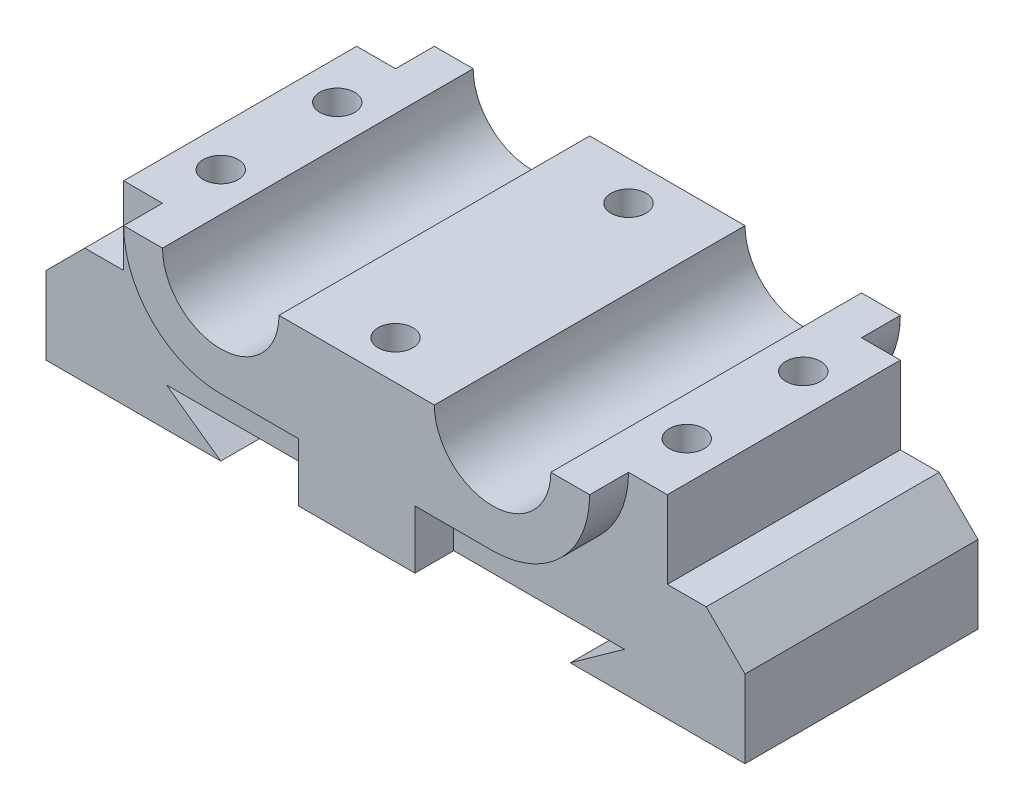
ISO-10303-21;
HEADER;
FILE_DESCRIPTION(('STEP AP214'),'2;1');
FILE_NAME('part.step','',(''),(''),'','','');
FILE_SCHEMA(('AUTOMOTIVE_DESIGN { 1 0 10303 214 1 1 1 1 }'));
ENDSEC;
DATA;
#1=APPLICATION_CONTEXT('core data for automotive mechanical design processes');
#2=APPLICATION_PROTOCOL_DEFINITION('international standard','automotive_design',2000,#1);
#3=PRODUCT_CONTEXT('',#1,'mechanical');
#4=PRODUCT('Part','Part','',(#3));
#5=PRODUCT_RELATED_PRODUCT_CATEGORY('part','',(#4));
#6=PRODUCT_DEFINITION_FORMATION('','',#4);
#7=PRODUCT_DEFINITION_CONTEXT('part definition',#1,'design');
#8=PRODUCT_DEFINITION('design','',#6,#7);
#9=PRODUCT_DEFINITION_SHAPE('','',#8);
#10=(LENGTH_UNIT() NAMED_UNIT(*) SI_UNIT(.MILLI.,.METRE.));
#11=(NAMED_UNIT(*) PLANE_ANGLE_UNIT() SI_UNIT($,.RADIAN.));
#12=(NAMED_UNIT(*) SI_UNIT($,.STERADIAN.) SOLID_ANGLE_UNIT());
#13=UNCERTAINTY_MEASURE_WITH_UNIT(LENGTH_MEASURE(1.E-05),#10,'distance_accuracy_value','');
#14=(GEOMETRIC_REPRESENTATION_CONTEXT(3) GLOBAL_UNCERTAINTY_ASSIGNED_CONTEXT((#13)) GLOBAL_UNIT_ASSIGNED_CONTEXT((#10,
#11,#12)) REPRESENTATION_CONTEXT('',''));
#15=CARTESIAN_POINT('',(0.,0.,0.));
#16=DIRECTION('',(0.,0.,1.));
#17=DIRECTION('',(1.,0.,0.));
#18=AXIS2_PLACEMENT_3D('',#15,#16,#17);
#19=CARTESIAN_POINT('',(17.5,25.,15.));
#20=DIRECTION('',(0.,0.,-1.));
#21=DIRECTION('',(-1.,0.,0.));
#22=AXIS2_PLACEMENT_3D('',#19,#20,#21);
#23=PLANE('',#22);
#24=DIRECTION('',(1.,0.,0.));
#25=VECTOR('',#24,1.);
#26=CARTESIAN_POINT('',(-45.,15.,15.));
#27=LINE('',#26,#25);
#28=CARTESIAN_POINT('',(-40.,15.,15.));
#29=VERTEX_POINT('',#28);
#30=CARTESIAN_POINT('',(-35.,15.,15.));
#31=VERTEX_POINT('',#30);
#32=EDGE_CURVE('E477',#29,#31,#27,.T.);
#33=ORIENTED_EDGE('',*,*,#32,.F.);
#34=DIRECTION('',(0.707106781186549,0.707106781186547,0.));
#35=VECTOR('',#34,1.);
#36=CARTESIAN_POINT('',(-45.,10.,15.));
#37=LINE('',#36,#35);
#38=CARTESIAN_POINT('',(-45.,10.,15.));
#39=VERTEX_POINT('',#38);
#40=EDGE_CURVE('E593',#29,#39,#37,.F.);
#41=ORIENTED_EDGE('',*,*,#40,.T.);
#42=DIRECTION('',(0.,1.,0.));
#43=VECTOR('',#42,1.);
#44=CARTESIAN_POINT('',(-45.,0.,15.));
#45=LINE('',#44,#43);
#46=CARTESIAN_POINT('',(-45.,0.,15.));
#47=VERTEX_POINT('',#46);
#48=EDGE_CURVE('E480',#47,#39,#45,.T.);
#49=ORIENTED_EDGE('',*,*,#48,.F.);
#50=DIRECTION('',(1.,0.,0.));
#51=VECTOR('',#50,1.);
#52=CARTESIAN_POINT('',(-45.,0.,15.));
#53=LINE('',#52,#51);
#54=CARTESIAN_POINT('',(-22.5,0.,15.));
#55=VERTEX_POINT('',#54);
#56=EDGE_CURVE('E484',#47,#55,#53,.T.);
#57=ORIENTED_EDGE('',*,*,#56,.T.);
#58=DIRECTION('',(-0.81262275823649,0.582790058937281,0.));
#59=VECTOR('',#58,1.);
#60=CARTESIAN_POINT('',(-22.5,0.,15.));
#61=LINE('',#60,#59);
#62=CARTESIAN_POINT('',(-29.4718309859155,5.,15.));
#63=VERTEX_POINT('',#62);
#64=EDGE_CURVE('E430',#55,#63,#61,.T.);
#65=ORIENTED_EDGE('',*,*,#64,.T.);
#66=DIRECTION('',(1.,0.,0.));
#67=VECTOR('',#66,1.);
#68=CARTESIAN_POINT('',(-29.4718309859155,5.,15.));
#69=LINE('',#68,#67);
#70=CARTESIAN_POINT('',(-7.5,5.,15.));
#71=VERTEX_POINT('',#70);
#72=EDGE_CURVE('E436',#63,#71,#69,.T.);
#73=ORIENTED_EDGE('',*,*,#72,.T.);
#74=DIRECTION('',(0.,-1.,0.));
#75=VECTOR('',#74,1.);
#76=CARTESIAN_POINT('',(-7.50000000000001,25.,15.));
#77=LINE('',#76,#75);
#78=CARTESIAN_POINT('',(-7.5,12.5,15.));
#79=VERTEX_POINT('',#78);
#80=EDGE_CURVE('E422',#79,#71,#77,.T.);
#81=ORIENTED_EDGE('',*,*,#80,.F.);
#82=DIRECTION('',(-1.,0.,0.));
#83=VECTOR('',#82,1.);
#84=CARTESIAN_POINT('',(17.5,12.5,15.));
#85=LINE('',#84,#83);
#86=CARTESIAN_POINT('',(-17.5,12.5,15.));
#87=VERTEX_POINT('',#86);
#88=EDGE_CURVE('E426',#79,#87,#85,.T.);
#89=ORIENTED_EDGE('',*,*,#88,.T.);
#90=CARTESIAN_POINT('',(-17.5,25.,15.));
#91=DIRECTION('',(0.,0.,1.));
#92=DIRECTION('',(1.,0.,0.));
#93=AXIS2_PLACEMENT_3D('',#90,#91,#92);
#94=CIRCLE('',#93,12.5);
#95=CARTESIAN_POINT('',(-30.,25.,15.));
#96=VERTEX_POINT('',#95);
#97=EDGE_CURVE('E465',#96,#87,#94,.T.);
#98=ORIENTED_EDGE('',*,*,#97,.F.);
#99=DIRECTION('',(1.,0.,0.));
#100=VECTOR('',#99,1.);
#101=CARTESIAN_POINT('',(-35.,25.,15.));
#102=LINE('',#101,#100);
#103=CARTESIAN_POINT('',(-35.,25.,15.));
#104=VERTEX_POINT('',#103);
#105=EDGE_CURVE('E469',#104,#96,#102,.T.);
#106=ORIENTED_EDGE('',*,*,#105,.F.);
#107=DIRECTION('',(0.,1.,0.));
#108=VECTOR('',#107,1.);
#109=CARTESIAN_POINT('',(-35.,15.,15.));
#110=LINE('',#109,#108);
#111=EDGE_CURVE('E473',#31,#104,#110,.T.);
#112=ORIENTED_EDGE('',*,*,#111,.F.);
#113=EDGE_LOOP('',(#33,#41,#49,#57,#65,#73,#81,#89,#98,#106,#112));
#114=FACE_BOUND('',#113,.T.);
#115=ADVANCED_FACE('F41',(#114),#23,.F.);
#116=CARTESIAN_POINT('',(17.5,25.,-15.));
#117=DIRECTION('',(0.,0.,-1.));
#118=DIRECTION('',(-1.,0.,0.));
#119=AXIS2_PLACEMENT_3D('',#116,#117,#118);
#120=PLANE('',#119);
#121=DIRECTION('',(0.,1.,0.));
#122=VECTOR('',#121,1.);
#123=CARTESIAN_POINT('',(-45.,0.,-15.));
#124=LINE('',#123,#122);
#125=CARTESIAN_POINT('',(-45.,0.,-15.));
#126=VERTEX_POINT('',#125);
#127=CARTESIAN_POINT('',(-45.,10.,-15.));
#128=VERTEX_POINT('',#127);
#129=EDGE_CURVE('E536',#126,#128,#124,.T.);
#130=ORIENTED_EDGE('',*,*,#129,.T.);
#131=DIRECTION('',(-0.707106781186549,-0.707106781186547,0.));
#132=VECTOR('',#131,1.);
#133=CARTESIAN_POINT('',(-6.24999999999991,48.75,-15.));
#134=LINE('',#133,#132);
#135=CARTESIAN_POINT('',(-40.,15.,-15.));
#136=VERTEX_POINT('',#135);
#137=EDGE_CURVE('E587',#128,#136,#134,.F.);
#138=ORIENTED_EDGE('',*,*,#137,.T.);
#139=DIRECTION('',(1.,0.,0.));
#140=VECTOR('',#139,1.);
#141=CARTESIAN_POINT('',(-45.,15.,-15.));
#142=LINE('',#141,#140);
#143=CARTESIAN_POINT('',(-35.,15.,-15.));
#144=VERTEX_POINT('',#143);
#145=EDGE_CURVE('E533',#136,#144,#142,.T.);
#146=ORIENTED_EDGE('',*,*,#145,.T.);
#147=DIRECTION('',(0.,1.,0.));
#148=VECTOR('',#147,1.);
#149=CARTESIAN_POINT('',(-35.,15.,-15.));
#150=LINE('',#149,#148);
#151=CARTESIAN_POINT('',(-35.,25.,-15.));
#152=VERTEX_POINT('',#151);
#153=EDGE_CURVE('E529',#144,#152,#150,.T.);
#154=ORIENTED_EDGE('',*,*,#153,.T.);
#155=DIRECTION('',(1.,0.,0.));
#156=VECTOR('',#155,1.);
#157=CARTESIAN_POINT('',(-35.,25.,-15.));
#158=LINE('',#157,#156);
#159=CARTESIAN_POINT('',(-30.,25.,-15.));
#160=VERTEX_POINT('',#159);
#161=EDGE_CURVE('E526',#152,#160,#158,.T.);
#162=ORIENTED_EDGE('',*,*,#161,.T.);
#163=CARTESIAN_POINT('',(-17.5,25.,-15.));
#164=DIRECTION('',(0.,0.,1.));
#165=DIRECTION('',(1.,0.,0.));
#166=AXIS2_PLACEMENT_3D('',#163,#164,#165);
#167=CIRCLE('',#166,12.5);
#168=CARTESIAN_POINT('',(-17.5,12.5,-15.));
#169=VERTEX_POINT('',#168);
#170=EDGE_CURVE('E523',#160,#169,#167,.T.);
#171=ORIENTED_EDGE('',*,*,#170,.T.);
#172=DIRECTION('',(1.,0.,0.));
#173=VECTOR('',#172,1.);
#174=CARTESIAN_POINT('',(-17.5,12.5,-15.));
#175=LINE('',#174,#173);
#176=CARTESIAN_POINT('',(-7.5,12.5,-15.));
#177=VERTEX_POINT('',#176);
#178=EDGE_CURVE('E520',#169,#177,#175,.T.);
#179=ORIENTED_EDGE('',*,*,#178,.T.);
#180=DIRECTION('',(0.,-1.,0.));
#181=VECTOR('',#180,1.);
#182=CARTESIAN_POINT('',(-7.50000000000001,25.,-15.));
#183=LINE('',#182,#181);
#184=CARTESIAN_POINT('',(-7.49999999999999,5.,-15.));
#185=VERTEX_POINT('',#184);
#186=EDGE_CURVE('E580',#177,#185,#183,.T.);
#187=ORIENTED_EDGE('',*,*,#186,.T.);
#188=DIRECTION('',(-1.,0.,0.));
#189=VECTOR('',#188,1.);
#190=CARTESIAN_POINT('',(29.4718309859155,5.,-15.));
#191=LINE('',#190,#189);
#192=CARTESIAN_POINT('',(-29.4718309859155,5.,-15.));
#193=VERTEX_POINT('',#192);
#194=EDGE_CURVE('E491',#185,#193,#191,.T.);
#195=ORIENTED_EDGE('',*,*,#194,.T.);
#196=DIRECTION('',(-0.81262275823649,0.582790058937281,0.));
#197=VECTOR('',#196,1.);
#198=CARTESIAN_POINT('',(-22.5,0.,-15.));
#199=LINE('',#198,#197);
#200=CARTESIAN_POINT('',(-22.5,0.,-15.));
#201=VERTEX_POINT('',#200);
#202=EDGE_CURVE('E429',#201,#193,#199,.T.);
#203=ORIENTED_EDGE('',*,*,#202,.F.);
#204=DIRECTION('',(1.,0.,0.));
#205=VECTOR('',#204,1.);
#206=CARTESIAN_POINT('',(-45.,0.,-15.));
#207=LINE('',#206,#205);
#208=EDGE_CURVE('E435',#126,#201,#207,.T.);
#209=ORIENTED_EDGE('',*,*,#208,.F.);
#210=EDGE_LOOP('',(#130,#138,#146,#154,#162,#171,#179,#187,#195,#203,#209));
#211=FACE_BOUND('',#210,.T.);
#212=ADVANCED_FACE('F704',(#211),#120,.T.);
#213=CARTESIAN_POINT('',(-22.5,0.,15.));
#214=DIRECTION('',(-0.582790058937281,-0.81262275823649,0.));
#215=DIRECTION('',(0.81262275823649,-0.582790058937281,0.));
#216=AXIS2_PLACEMENT_3D('',#213,#214,#215);
#217=PLANE('',#216);
#218=ORIENTED_EDGE('',*,*,#202,.T.);
#219=DIRECTION('',(0.,0.,-1.));
#220=VECTOR('',#219,1.);
#221=CARTESIAN_POINT('',(-29.4718309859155,5.,15.));
#222=LINE('',#221,#220);
#223=EDGE_CURVE('E572',#63,#193,#222,.T.);
#224=ORIENTED_EDGE('',*,*,#223,.F.);
#225=ORIENTED_EDGE('',*,*,#64,.F.);
#226=DIRECTION('',(0.,0.,-1.));
#227=VECTOR('',#226,1.);
#228=CARTESIAN_POINT('',(-22.5,0.,15.));
#229=LINE('',#228,#227);
#230=EDGE_CURVE('E487',#55,#201,#229,.T.);
#231=ORIENTED_EDGE('',*,*,#230,.T.);
#232=EDGE_LOOP('',(#218,#224,#225,#231));
#233=FACE_BOUND('',#232,.T.);
#234=ADVANCED_FACE('F717',(#233),#217,.F.);
#235=CARTESIAN_POINT('',(29.4718309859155,5.,15.));
#236=DIRECTION('',(0.,-1.,0.));
#237=DIRECTION('',(0.,0.,-1.));
#238=AXIS2_PLACEMENT_3D('',#235,#236,#237);
#239=PLANE('',#238);
#240=CARTESIAN_POINT('',(7.5,5.,15.));
#241=VERTEX_POINT('',#240);
#242=CARTESIAN_POINT('',(29.4718309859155,5.,15.));
#243=VERTEX_POINT('',#242);
#244=EDGE_CURVE('E434',#241,#243,#69,.T.);
#245=ORIENTED_EDGE('',*,*,#244,.F.);
#246=DIRECTION('',(0.,0.,-1.));
#247=VECTOR('',#246,1.);
#248=CARTESIAN_POINT('',(7.5,5.,20.));
#249=LINE('',#248,#247);
#250=CARTESIAN_POINT('',(7.5,5.,20.));
#251=VERTEX_POINT('',#250);
#252=EDGE_CURVE('E391',#251,#241,#249,.T.);
#253=ORIENTED_EDGE('',*,*,#252,.F.);
#254=DIRECTION('',(1.,0.,0.));
#255=VECTOR('',#254,1.);
#256=CARTESIAN_POINT('',(0.,5.,20.));
#257=LINE('',#256,#255);
#258=CARTESIAN_POINT('',(-7.5,5.,20.));
#259=VERTEX_POINT('',#258);
#260=EDGE_CURVE('E312',#259,#251,#257,.T.);
#261=ORIENTED_EDGE('',*,*,#260,.F.);
#262=DIRECTION('',(0.,0.,-1.));
#263=VECTOR('',#262,1.);
#264=CARTESIAN_POINT('',(-7.5,5.,20.));
#265=LINE('',#264,#263);
#266=EDGE_CURVE('E396',#259,#71,#265,.T.);
#267=ORIENTED_EDGE('',*,*,#266,.T.);
#268=ORIENTED_EDGE('',*,*,#72,.F.);
#269=ORIENTED_EDGE('',*,*,#223,.T.);
#270=ORIENTED_EDGE('',*,*,#194,.F.);
#271=CARTESIAN_POINT('',(-7.5,5.,-20.));
#272=VERTEX_POINT('',#271);
#273=EDGE_CURVE('E395',#185,#272,#265,.T.);
#274=ORIENTED_EDGE('',*,*,#273,.T.);
#275=DIRECTION('',(1.,0.,0.));
#276=VECTOR('',#275,1.);
#277=CARTESIAN_POINT('',(0.,5.,-20.));
#278=LINE('',#277,#276);
#279=CARTESIAN_POINT('',(7.5,5.,-20.));
#280=VERTEX_POINT('',#279);
#281=EDGE_CURVE('E354',#272,#280,#278,.T.);
#282=ORIENTED_EDGE('',*,*,#281,.T.);
#283=CARTESIAN_POINT('',(7.5,5.,-15.));
#284=VERTEX_POINT('',#283);
#285=EDGE_CURVE('E390',#284,#280,#249,.T.);
#286=ORIENTED_EDGE('',*,*,#285,.F.);
#287=CARTESIAN_POINT('',(29.4718309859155,5.,-15.));
#288=VERTEX_POINT('',#287);
#289=EDGE_CURVE('E492',#288,#284,#191,.T.);
#290=ORIENTED_EDGE('',*,*,#289,.F.);
#291=DIRECTION('',(0.,0.,-1.));
#292=VECTOR('',#291,1.);
#293=CARTESIAN_POINT('',(29.4718309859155,5.,15.));
#294=LINE('',#293,#292);
#295=EDGE_CURVE('E569',#243,#288,#294,.T.);
#296=ORIENTED_EDGE('',*,*,#295,.F.);
#297=EDGE_LOOP('',(#245,#253,#261,#267,#268,#269,#270,#274,#282,#286,#290,#296));
#298=FACE_BOUND('',#297,.T.);
#299=ADVANCED_FACE('F652',(#298),#239,.T.);
#300=CARTESIAN_POINT('',(22.5,0.,15.));
#301=DIRECTION('',(-0.582790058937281,0.81262275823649,0.));
#302=DIRECTION('',(-0.81262275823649,-0.582790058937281,0.));
#303=AXIS2_PLACEMENT_3D('',#300,#301,#302);
#304=PLANE('',#303);
#305=DIRECTION('',(0.81262275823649,0.582790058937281,0.));
#306=VECTOR('',#305,1.);
#307=CARTESIAN_POINT('',(22.5,0.,-15.));
#308=LINE('',#307,#306);
#309=CARTESIAN_POINT('',(22.5,0.,-15.));
#310=VERTEX_POINT('',#309);
#311=EDGE_CURVE('E495',#310,#288,#308,.T.);
#312=ORIENTED_EDGE('',*,*,#311,.F.);
#313=DIRECTION('',(0.,0.,-1.));
#314=VECTOR('',#313,1.);
#315=CARTESIAN_POINT('',(22.5,0.,15.));
#316=LINE('',#315,#314);
#317=CARTESIAN_POINT('',(22.5,0.,15.));
#318=VERTEX_POINT('',#317);
#319=EDGE_CURVE('E566',#318,#310,#316,.T.);
#320=ORIENTED_EDGE('',*,*,#319,.F.);
#321=DIRECTION('',(0.81262275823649,0.582790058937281,0.));
#322=VECTOR('',#321,1.);
#323=CARTESIAN_POINT('',(22.5,0.,15.));
#324=LINE('',#323,#322);
#325=EDGE_CURVE('E439',#318,#243,#324,.T.);
#326=ORIENTED_EDGE('',*,*,#325,.T.);
#327=ORIENTED_EDGE('',*,*,#295,.T.);
#328=EDGE_LOOP('',(#312,#320,#326,#327));
#329=FACE_BOUND('',#328,.T.);
#330=ADVANCED_FACE('F778',(#329),#304,.T.);
#331=CARTESIAN_POINT('',(45.,0.,15.));
#332=DIRECTION('',(0.,-1.,0.));
#333=DIRECTION('',(0.,0.,-1.));
#334=AXIS2_PLACEMENT_3D('',#331,#332,#333);
#335=PLANE('',#334);
#336=DIRECTION('',(-1.,0.,0.));
#337=VECTOR('',#336,1.);
#338=CARTESIAN_POINT('',(45.,0.,-15.));
#339=LINE('',#338,#337);
#340=CARTESIAN_POINT('',(45.,0.,-15.));
#341=VERTEX_POINT('',#340);
#342=EDGE_CURVE('E499',#341,#310,#339,.T.);
#343=ORIENTED_EDGE('',*,*,#342,.F.);
#344=DIRECTION('',(0.,0.,-1.));
#345=VECTOR('',#344,1.);
#346=CARTESIAN_POINT('',(45.,0.,15.));
#347=LINE('',#346,#345);
#348=CARTESIAN_POINT('',(45.,0.,15.));
#349=VERTEX_POINT('',#348);
#350=EDGE_CURVE('E563',#349,#341,#347,.T.);
#351=ORIENTED_EDGE('',*,*,#350,.F.);
#352=DIRECTION('',(-1.,0.,0.));
#353=VECTOR('',#352,1.);
#354=CARTESIAN_POINT('',(45.,0.,15.));
#355=LINE('',#354,#353);
#356=EDGE_CURVE('E443',#349,#318,#355,.T.);
#357=ORIENTED_EDGE('',*,*,#356,.T.);
#358=ORIENTED_EDGE('',*,*,#319,.T.);
#359=EDGE_LOOP('',(#343,#351,#357,#358));
#360=FACE_BOUND('',#359,.T.);
#361=ADVANCED_FACE('F775',(#360),#335,.T.);
#362=CARTESIAN_POINT('',(45.,0.,15.));
#363=DIRECTION('',(-1.,0.,0.));
#364=DIRECTION('',(0.,0.,1.));
#365=AXIS2_PLACEMENT_3D('',#362,#363,#364);
#366=PLANE('',#365);
#367=DIRECTION('',(0.,1.,0.));
#368=VECTOR('',#367,1.);
#369=CARTESIAN_POINT('',(45.,0.,-15.));
#370=LINE('',#369,#368);
#371=CARTESIAN_POINT('',(45.,9.99999999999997,-15.));
#372=VERTEX_POINT('',#371);
#373=EDGE_CURVE('E503',#341,#372,#370,.T.);
#374=ORIENTED_EDGE('',*,*,#373,.T.);
#375=DIRECTION('',(0.,0.,1.));
#376=VECTOR('',#375,1.);
#377=CARTESIAN_POINT('',(45.,9.99999999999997,15.));
#378=LINE('',#377,#376);
#379=CARTESIAN_POINT('',(45.,9.99999999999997,15.));
#380=VERTEX_POINT('',#379);
#381=EDGE_CURVE('E51',#372,#380,#378,.T.);
#382=ORIENTED_EDGE('',*,*,#381,.T.);
#383=DIRECTION('',(0.,1.,0.));
#384=VECTOR('',#383,1.);
#385=CARTESIAN_POINT('',(45.,0.,15.));
#386=LINE('',#385,#384);
#387=EDGE_CURVE('E447',#349,#380,#386,.T.);
#388=ORIENTED_EDGE('',*,*,#387,.F.);
#389=ORIENTED_EDGE('',*,*,#350,.T.);
#390=EDGE_LOOP('',(#374,#382,#388,#389));
#391=FACE_BOUND('',#390,.T.);
#392=ADVANCED_FACE('F771',(#391),#366,.F.);
#393=CARTESIAN_POINT('',(45.,15.,15.));
#394=DIRECTION('',(0.,-1.,0.));
#395=DIRECTION('',(0.,0.,-1.));
#396=AXIS2_PLACEMENT_3D('',#393,#394,#395);
#397=PLANE('',#396);
#398=DIRECTION('',(-1.,0.,0.));
#399=VECTOR('',#398,1.);
#400=CARTESIAN_POINT('',(45.,15.,15.));
#401=LINE('',#400,#399);
#402=CARTESIAN_POINT('',(40.,15.,15.));
#403=VERTEX_POINT('',#402);
#404=CARTESIAN_POINT('',(35.,15.,15.));
#405=VERTEX_POINT('',#404);
#406=EDGE_CURVE('E450',#403,#405,#401,.T.);
#407=ORIENTED_EDGE('',*,*,#406,.F.);
#408=DIRECTION('',(0.,0.,-1.));
#409=VECTOR('',#408,1.);
#410=CARTESIAN_POINT('',(40.,15.,15.));
#411=LINE('',#410,#409);
#412=CARTESIAN_POINT('',(40.,15.,-15.));
#413=VERTEX_POINT('',#412);
#414=EDGE_CURVE('E596',#403,#413,#411,.T.);
#415=ORIENTED_EDGE('',*,*,#414,.T.);
#416=DIRECTION('',(-1.,0.,0.));
#417=VECTOR('',#416,1.);
#418=CARTESIAN_POINT('',(45.,15.,-15.));
#419=LINE('',#418,#417);
#420=CARTESIAN_POINT('',(35.,15.,-15.));
#421=VERTEX_POINT('',#420);
#422=EDGE_CURVE('E506',#413,#421,#419,.T.);
#423=ORIENTED_EDGE('',*,*,#422,.T.);
#424=DIRECTION('',(0.,0.,-1.));
#425=VECTOR('',#424,1.);
#426=CARTESIAN_POINT('',(35.,15.,15.));
#427=LINE('',#426,#425);
#428=EDGE_CURVE('E559',#405,#421,#427,.T.);
#429=ORIENTED_EDGE('',*,*,#428,.F.);
#430=EDGE_LOOP('',(#407,#415,#423,#429));
#431=FACE_BOUND('',#430,.T.);
#432=ADVANCED_FACE('F768',(#431),#397,.F.);
#433=CARTESIAN_POINT('',(35.,15.,15.));
#434=DIRECTION('',(-1.,0.,0.));
#435=DIRECTION('',(0.,0.,1.));
#436=AXIS2_PLACEMENT_3D('',#433,#434,#435);
#437=PLANE('',#436);
#438=DIRECTION('',(0.,1.,0.));
#439=VECTOR('',#438,1.);
#440=CARTESIAN_POINT('',(35.,15.,-15.));
#441=LINE('',#440,#439);
#442=CARTESIAN_POINT('',(35.,25.,-15.));
#443=VERTEX_POINT('',#442);
#444=EDGE_CURVE('E509',#421,#443,#441,.T.);
#445=ORIENTED_EDGE('',*,*,#444,.T.);
#446=DIRECTION('',(0.,0.,-1.));
#447=VECTOR('',#446,1.);
#448=CARTESIAN_POINT('',(35.,25.,15.));
#449=LINE('',#448,#447);
#450=CARTESIAN_POINT('',(35.,25.,15.));
#451=VERTEX_POINT('',#450);
#452=EDGE_CURVE('E555',#451,#443,#449,.T.);
#453=ORIENTED_EDGE('',*,*,#452,.F.);
#454=DIRECTION('',(0.,1.,0.));
#455=VECTOR('',#454,1.);
#456=CARTESIAN_POINT('',(35.,15.,15.));
#457=LINE('',#456,#455);
#458=EDGE_CURVE('E453',#405,#451,#457,.T.);
#459=ORIENTED_EDGE('',*,*,#458,.F.);
#460=ORIENTED_EDGE('',*,*,#428,.T.);
#461=EDGE_LOOP('',(#445,#453,#459,#460));
#462=FACE_BOUND('',#461,.T.);
#463=ADVANCED_FACE('F675',(#462),#437,.F.);
#464=CARTESIAN_POINT('',(35.,25.,15.));
#465=DIRECTION('',(0.,-1.,0.));
#466=DIRECTION('',(0.,0.,-1.));
#467=AXIS2_PLACEMENT_3D('',#464,#465,#466);
#468=PLANE('',#467);
#469=CARTESIAN_POINT('',(30.,25.,-7.5));
#470=DIRECTION('',(0.,1.,0.));
#471=DIRECTION('',(0.,0.,-1.));
#472=AXIS2_PLACEMENT_3D('',#469,#470,#471);
#473=CIRCLE('',#472,2.25);
#474=CARTESIAN_POINT('',(30.,25.,-9.75));
#475=VERTEX_POINT('',#474);
#476=EDGE_CURVE('E1011',#475,#475,#473,.T.);
#477=ORIENTED_EDGE('',*,*,#476,.F.);
#478=EDGE_LOOP('',(#477));
#479=FACE_BOUND('',#478,.T.);
#480=CARTESIAN_POINT('',(30.,25.,7.5));
#481=DIRECTION('',(0.,1.,0.));
#482=DIRECTION('',(0.,0.,1.));
#483=AXIS2_PLACEMENT_3D('',#480,#481,#482);
#484=CIRCLE('',#483,2.25);
#485=CARTESIAN_POINT('',(30.,25.,9.75));
#486=VERTEX_POINT('',#485);
#487=EDGE_CURVE('E1010',#486,#486,#484,.T.);
#488=ORIENTED_EDGE('',*,*,#487,.F.);
#489=EDGE_LOOP('',(#488));
#490=FACE_BOUND('',#489,.T.);
#491=DIRECTION('',(-1.,0.,0.));
#492=VECTOR('',#491,1.);
#493=CARTESIAN_POINT('',(35.,25.,-15.));
#494=LINE('',#493,#492);
#495=CARTESIAN_POINT('',(30.,25.,-15.));
#496=VERTEX_POINT('',#495);
#497=EDGE_CURVE('E512',#443,#496,#494,.T.);
#498=ORIENTED_EDGE('',*,*,#497,.T.);
#499=DIRECTION('',(0.,0.,-1.));
#500=VECTOR('',#499,1.);
#501=CARTESIAN_POINT('',(30.,25.,20.));
#502=LINE('',#501,#500);
#503=CARTESIAN_POINT('',(30.,25.,-20.));
#504=VERTEX_POINT('',#503);
#505=EDGE_CURVE('E375',#496,#504,#502,.T.);
#506=ORIENTED_EDGE('',*,*,#505,.T.);
#507=DIRECTION('',(-1.,0.,0.));
#508=VECTOR('',#507,1.);
#509=CARTESIAN_POINT('',(0.,25.,-20.));
#510=LINE('',#509,#508);
#511=CARTESIAN_POINT('',(25.,25.,-20.));
#512=VERTEX_POINT('',#511);
#513=EDGE_CURVE('E288',#504,#512,#510,.T.);
#514=ORIENTED_EDGE('',*,*,#513,.T.);
#515=DIRECTION('',(0.,0.,-1.));
#516=VECTOR('',#515,1.);
#517=CARTESIAN_POINT('',(25.,25.,20.));
#518=LINE('',#517,#516);
#519=CARTESIAN_POINT('',(25.,25.,20.));
#520=VERTEX_POINT('',#519);
#521=EDGE_CURVE('E327',#520,#512,#518,.T.);
#522=ORIENTED_EDGE('',*,*,#521,.F.);
#523=DIRECTION('',(-1.,0.,0.));
#524=VECTOR('',#523,1.);
#525=CARTESIAN_POINT('',(0.,25.,20.));
#526=LINE('',#525,#524);
#527=CARTESIAN_POINT('',(30.,25.,20.));
#528=VERTEX_POINT('',#527);
#529=EDGE_CURVE('E285',#528,#520,#526,.T.);
#530=ORIENTED_EDGE('',*,*,#529,.F.);
#531=CARTESIAN_POINT('',(30.,25.,15.));
#532=VERTEX_POINT('',#531);
#533=EDGE_CURVE('E376',#528,#532,#502,.T.);
#534=ORIENTED_EDGE('',*,*,#533,.T.);
#535=DIRECTION('',(-1.,0.,0.));
#536=VECTOR('',#535,1.);
#537=CARTESIAN_POINT('',(35.,25.,15.));
#538=LINE('',#537,#536);
#539=EDGE_CURVE('E456',#451,#532,#538,.T.);
#540=ORIENTED_EDGE('',*,*,#539,.F.);
#541=ORIENTED_EDGE('',*,*,#452,.T.);
#542=EDGE_LOOP('',(#498,#506,#514,#522,#530,#534,#540,#541));
#543=FACE_BOUND('',#542,.T.);
#544=ADVANCED_FACE('F615',(#479,#490,#543),#468,.F.);
#545=CARTESIAN_POINT('',(-35.,25.,15.));
#546=DIRECTION('',(0.,1.,0.));
#547=DIRECTION('',(0.,0.,1.));
#548=AXIS2_PLACEMENT_3D('',#545,#546,#547);
#549=PLANE('',#548);
#550=CARTESIAN_POINT('',(-30.,25.,7.5));
#551=DIRECTION('',(0.,1.,0.));
#552=DIRECTION('',(0.,0.,-1.));
#553=AXIS2_PLACEMENT_3D('',#550,#551,#552);
#554=CIRCLE('',#553,2.25);
#555=CARTESIAN_POINT('',(-30.,25.,5.25));
#556=VERTEX_POINT('',#555);
#557=EDGE_CURVE('E1035',#556,#556,#554,.T.);
#558=ORIENTED_EDGE('',*,*,#557,.F.);
#559=EDGE_LOOP('',(#558));
#560=FACE_BOUND('',#559,.T.);
#561=CARTESIAN_POINT('',(-30.,25.,-7.5));
#562=DIRECTION('',(0.,1.,0.));
#563=DIRECTION('',(0.,0.,1.));
#564=AXIS2_PLACEMENT_3D('',#561,#562,#563);
#565=CIRCLE('',#564,2.25);
#566=CARTESIAN_POINT('',(-30.,25.,-5.25));
#567=VERTEX_POINT('',#566);
#568=EDGE_CURVE('E1027',#567,#567,#565,.T.);
#569=ORIENTED_EDGE('',*,*,#568,.F.);
#570=EDGE_LOOP('',(#569));
#571=FACE_BOUND('',#570,.T.);
#572=ORIENTED_EDGE('',*,*,#161,.F.);
#573=DIRECTION('',(0.,0.,-1.));
#574=VECTOR('',#573,1.);
#575=CARTESIAN_POINT('',(-35.,25.,15.));
#576=LINE('',#575,#574);
#577=EDGE_CURVE('E552',#104,#152,#576,.T.);
#578=ORIENTED_EDGE('',*,*,#577,.F.);
#579=ORIENTED_EDGE('',*,*,#105,.T.);
#580=DIRECTION('',(0.,0.,-1.));
#581=VECTOR('',#580,1.);
#582=CARTESIAN_POINT('',(-30.,25.,20.));
#583=LINE('',#582,#581);
#584=CARTESIAN_POINT('',(-30.,25.,20.));
#585=VERTEX_POINT('',#584);
#586=EDGE_CURVE('E411',#585,#96,#583,.T.);
#587=ORIENTED_EDGE('',*,*,#586,.F.);
#588=DIRECTION('',(1.,0.,0.));
#589=VECTOR('',#588,1.);
#590=CARTESIAN_POINT('',(0.,25.,20.));
#591=LINE('',#590,#589);
#592=CARTESIAN_POINT('',(-25.,25.,20.));
#593=VERTEX_POINT('',#592);
#594=EDGE_CURVE('E295',#585,#593,#591,.T.);
#595=ORIENTED_EDGE('',*,*,#594,.T.);
#596=DIRECTION('',(0.,0.,-1.));
#597=VECTOR('',#596,1.);
#598=CARTESIAN_POINT('',(-25.,25.,20.));
#599=LINE('',#598,#597);
#600=CARTESIAN_POINT('',(-25.,25.,-20.));
#601=VERTEX_POINT('',#600);
#602=EDGE_CURVE('E415',#593,#601,#599,.T.);
#603=ORIENTED_EDGE('',*,*,#602,.T.);
#604=DIRECTION('',(1.,0.,0.));
#605=VECTOR('',#604,1.);
#606=CARTESIAN_POINT('',(0.,25.,-20.));
#607=LINE('',#606,#605);
#608=CARTESIAN_POINT('',(-30.,25.,-20.));
#609=VERTEX_POINT('',#608);
#610=EDGE_CURVE('E338',#609,#601,#607,.T.);
#611=ORIENTED_EDGE('',*,*,#610,.F.);
#612=EDGE_CURVE('E410',#160,#609,#583,.T.);
#613=ORIENTED_EDGE('',*,*,#612,.F.);
#614=EDGE_LOOP('',(#572,#578,#579,#587,#595,#603,#611,#613));
#615=FACE_BOUND('',#614,.T.);
#616=ADVANCED_FACE('F634',(#560,#571,#615),#549,.T.);
#617=CARTESIAN_POINT('',(-35.,15.,15.));
#618=DIRECTION('',(-1.,0.,0.));
#619=DIRECTION('',(0.,0.,1.));
#620=AXIS2_PLACEMENT_3D('',#617,#618,#619);
#621=PLANE('',#620);
#622=ORIENTED_EDGE('',*,*,#153,.F.);
#623=DIRECTION('',(0.,0.,-1.));
#624=VECTOR('',#623,1.);
#625=CARTESIAN_POINT('',(-35.,15.,15.));
#626=LINE('',#625,#624);
#627=EDGE_CURVE('E548',#31,#144,#626,.T.);
#628=ORIENTED_EDGE('',*,*,#627,.F.);
#629=ORIENTED_EDGE('',*,*,#111,.T.);
#630=ORIENTED_EDGE('',*,*,#577,.T.);
#631=EDGE_LOOP('',(#622,#628,#629,#630));
#632=FACE_BOUND('',#631,.T.);
#633=ADVANCED_FACE('F708',(#632),#621,.T.);
#634=CARTESIAN_POINT('',(-45.,15.,15.));
#635=DIRECTION('',(0.,1.,0.));
#636=DIRECTION('',(0.,0.,1.));
#637=AXIS2_PLACEMENT_3D('',#634,#635,#636);
#638=PLANE('',#637);
#639=ORIENTED_EDGE('',*,*,#145,.F.);
#640=DIRECTION('',(0.,0.,1.));
#641=VECTOR('',#640,1.);
#642=CARTESIAN_POINT('',(-40.,15.,15.));
#643=LINE('',#642,#641);
#644=EDGE_CURVE('E590',#136,#29,#643,.T.);
#645=ORIENTED_EDGE('',*,*,#644,.T.);
#646=ORIENTED_EDGE('',*,*,#32,.T.);
#647=ORIENTED_EDGE('',*,*,#627,.T.);
#648=EDGE_LOOP('',(#639,#645,#646,#647));
#649=FACE_BOUND('',#648,.T.);
#650=ADVANCED_FACE('F751',(#649),#638,.T.);
#651=CARTESIAN_POINT('',(-45.,0.,15.));
#652=DIRECTION('',(-1.,0.,0.));
#653=DIRECTION('',(0.,0.,1.));
#654=AXIS2_PLACEMENT_3D('',#651,#652,#653);
#655=PLANE('',#654);
#656=ORIENTED_EDGE('',*,*,#48,.T.);
#657=DIRECTION('',(0.,0.,-1.));
#658=VECTOR('',#657,1.);
#659=CARTESIAN_POINT('',(-45.,10.,15.));
#660=LINE('',#659,#658);
#661=EDGE_CURVE('E583',#39,#128,#660,.T.);
#662=ORIENTED_EDGE('',*,*,#661,.T.);
#663=ORIENTED_EDGE('',*,*,#129,.F.);
#664=DIRECTION('',(0.,0.,-1.));
#665=VECTOR('',#664,1.);
#666=CARTESIAN_POINT('',(-45.,0.,15.));
#667=LINE('',#666,#665);
#668=EDGE_CURVE('E545',#47,#126,#667,.T.);
#669=ORIENTED_EDGE('',*,*,#668,.F.);
#670=EDGE_LOOP('',(#656,#662,#663,#669));
#671=FACE_BOUND('',#670,.T.);
#672=ADVANCED_FACE('F745',(#671),#655,.T.);
#673=CARTESIAN_POINT('',(-45.,0.,15.));
#674=DIRECTION('',(0.,1.,0.));
#675=DIRECTION('',(0.,0.,1.));
#676=AXIS2_PLACEMENT_3D('',#673,#674,#675);
#677=PLANE('',#676);
#678=ORIENTED_EDGE('',*,*,#208,.T.);
#679=ORIENTED_EDGE('',*,*,#230,.F.);
#680=ORIENTED_EDGE('',*,*,#56,.F.);
#681=ORIENTED_EDGE('',*,*,#668,.T.);
#682=EDGE_LOOP('',(#678,#679,#680,#681));
#683=FACE_BOUND('',#682,.T.);
#684=ADVANCED_FACE('F740',(#683),#677,.F.);
#685=ORIENTED_EDGE('',*,*,#387,.T.);
#686=DIRECTION('',(0.707106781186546,-0.707106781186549,0.));
#687=VECTOR('',#686,1.);
#688=CARTESIAN_POINT('',(40.,15.,15.));
#689=LINE('',#688,#687);
#690=EDGE_CURVE('E11',#380,#403,#689,.F.);
#691=ORIENTED_EDGE('',*,*,#690,.T.);
#692=ORIENTED_EDGE('',*,*,#406,.T.);
#693=ORIENTED_EDGE('',*,*,#458,.T.);
#694=ORIENTED_EDGE('',*,*,#539,.T.);
#695=CARTESIAN_POINT('',(17.5,25.,15.));
#696=DIRECTION('',(0.,0.,-1.));
#697=DIRECTION('',(-1.,0.,0.));
#698=AXIS2_PLACEMENT_3D('',#695,#696,#697);
#699=CIRCLE('',#698,12.5);
#700=CARTESIAN_POINT('',(17.5,12.5,15.));
#701=VERTEX_POINT('',#700);
#702=EDGE_CURVE('E459',#532,#701,#699,.T.);
#703=ORIENTED_EDGE('',*,*,#702,.T.);
#704=DIRECTION('',(-1.,0.,0.));
#705=VECTOR('',#704,1.);
#706=CARTESIAN_POINT('',(17.5,12.5,15.));
#707=LINE('',#706,#705);
#708=CARTESIAN_POINT('',(7.5,12.5,15.));
#709=VERTEX_POINT('',#708);
#710=EDGE_CURVE('E462',#701,#709,#707,.T.);
#711=ORIENTED_EDGE('',*,*,#710,.T.);
#712=DIRECTION('',(0.,-1.,0.));
#713=VECTOR('',#712,1.);
#714=CARTESIAN_POINT('',(7.50000000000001,25.,15.));
#715=LINE('',#714,#713);
#716=EDGE_CURVE('E275',#709,#241,#715,.T.);
#717=ORIENTED_EDGE('',*,*,#716,.T.);
#718=ORIENTED_EDGE('',*,*,#244,.T.);
#719=ORIENTED_EDGE('',*,*,#325,.F.);
#720=ORIENTED_EDGE('',*,*,#356,.F.);
#721=EDGE_LOOP('',(#685,#691,#692,#693,#694,#703,#711,#717,#718,#719,#720));
#722=FACE_BOUND('',#721,.T.);
#723=ADVANCED_FACE('F670',(#722),#23,.F.);
#724=ORIENTED_EDGE('',*,*,#422,.F.);
#725=DIRECTION('',(-0.707106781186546,0.707106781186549,0.));
#726=VECTOR('',#725,1.);
#727=CARTESIAN_POINT('',(23.7500000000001,31.25,-15.));
#728=LINE('',#727,#726);
#729=EDGE_CURVE('E65',#413,#372,#728,.F.);
#730=ORIENTED_EDGE('',*,*,#729,.T.);
#731=ORIENTED_EDGE('',*,*,#373,.F.);
#732=ORIENTED_EDGE('',*,*,#342,.T.);
#733=ORIENTED_EDGE('',*,*,#311,.T.);
#734=ORIENTED_EDGE('',*,*,#289,.T.);
#735=DIRECTION('',(0.,-1.,0.));
#736=VECTOR('',#735,1.);
#737=CARTESIAN_POINT('',(7.50000000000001,25.,-15.));
#738=LINE('',#737,#736);
#739=CARTESIAN_POINT('',(7.5,12.5,-15.));
#740=VERTEX_POINT('',#739);
#741=EDGE_CURVE('E576',#740,#284,#738,.T.);
#742=ORIENTED_EDGE('',*,*,#741,.F.);
#743=CARTESIAN_POINT('',(17.5,12.5,-15.));
#744=VERTEX_POINT('',#743);
#745=EDGE_CURVE('E519',#740,#744,#175,.T.);
#746=ORIENTED_EDGE('',*,*,#745,.T.);
#747=CARTESIAN_POINT('',(17.5,25.,-15.));
#748=DIRECTION('',(0.,0.,-1.));
#749=DIRECTION('',(-1.,0.,0.));
#750=AXIS2_PLACEMENT_3D('',#747,#748,#749);
#751=CIRCLE('',#750,12.5);
#752=EDGE_CURVE('E515',#496,#744,#751,.T.);
#753=ORIENTED_EDGE('',*,*,#752,.F.);
#754=ORIENTED_EDGE('',*,*,#497,.F.);
#755=ORIENTED_EDGE('',*,*,#444,.F.);
#756=EDGE_LOOP('',(#724,#730,#731,#732,#733,#734,#742,#746,#753,#754,#755));
#757=FACE_BOUND('',#756,.T.);
#758=ADVANCED_FACE('F677',(#757),#120,.T.);
#759=CARTESIAN_POINT('',(-17.5,25.,20.));
#760=DIRECTION('',(0.,0.,-1.));
#761=DIRECTION('',(-1.,0.,0.));
#762=AXIS2_PLACEMENT_3D('',#759,#760,#761);
#763=CYLINDRICAL_SURFACE('',#762,12.5);
#764=ORIENTED_EDGE('',*,*,#586,.T.);
#765=ORIENTED_EDGE('',*,*,#97,.T.);
#766=DIRECTION('',(0.,0.,-1.));
#767=VECTOR('',#766,1.);
#768=CARTESIAN_POINT('',(-17.5,12.5,20.));
#769=LINE('',#768,#767);
#770=CARTESIAN_POINT('',(-17.5,12.5,20.));
#771=VERTEX_POINT('',#770);
#772=EDGE_CURVE('E406',#771,#87,#769,.T.);
#773=ORIENTED_EDGE('',*,*,#772,.F.);
#774=CARTESIAN_POINT('',(-17.5,25.,20.));
#775=DIRECTION('',(0.,0.,1.));
#776=DIRECTION('',(1.,0.,0.));
#777=AXIS2_PLACEMENT_3D('',#774,#775,#776);
#778=CIRCLE('',#777,12.5);
#779=EDGE_CURVE('E302',#585,#771,#778,.T.);
#780=ORIENTED_EDGE('',*,*,#779,.F.);
#781=EDGE_LOOP('',(#764,#765,#773,#780));
#782=FACE_BOUND('',#781,.T.);
#783=ADVANCED_FACE('F639',(#782),#763,.T.);
#784=CARTESIAN_POINT('',(0.,12.5,20.));
#785=DIRECTION('',(0.,-1.,0.));
#786=DIRECTION('',(1.,0.,0.));
#787=AXIS2_PLACEMENT_3D('',#784,#785,#786);
#788=PLANE('',#787);
#789=ORIENTED_EDGE('',*,*,#88,.F.);
#790=DIRECTION('',(0.,0.,-1.));
#791=VECTOR('',#790,1.);
#792=CARTESIAN_POINT('',(-7.5,12.5,20.));
#793=LINE('',#792,#791);
#794=CARTESIAN_POINT('',(-7.5,12.5,20.));
#795=VERTEX_POINT('',#794);
#796=EDGE_CURVE('E401',#795,#79,#793,.T.);
#797=ORIENTED_EDGE('',*,*,#796,.F.);
#798=DIRECTION('',(-1.,0.,0.));
#799=VECTOR('',#798,1.);
#800=CARTESIAN_POINT('',(0.,12.5,20.));
#801=LINE('',#800,#799);
#802=EDGE_CURVE('E305',#795,#771,#801,.T.);
#803=ORIENTED_EDGE('',*,*,#802,.T.);
#804=ORIENTED_EDGE('',*,*,#772,.T.);
#805=EDGE_LOOP('',(#789,#797,#803,#804));
#806=FACE_BOUND('',#805,.T.);
#807=ADVANCED_FACE('F645',(#806),#788,.T.);
#808=CARTESIAN_POINT('',(-7.5,0.,20.));
#809=DIRECTION('',(1.,0.,0.));
#810=DIRECTION('',(0.,1.,0.));
#811=AXIS2_PLACEMENT_3D('',#808,#809,#810);
#812=PLANE('',#811);
#813=ORIENTED_EDGE('',*,*,#796,.T.);
#814=ORIENTED_EDGE('',*,*,#80,.T.);
#815=ORIENTED_EDGE('',*,*,#266,.F.);
#816=DIRECTION('',(0.,-1.,0.));
#817=VECTOR('',#816,1.);
#818=CARTESIAN_POINT('',(-7.5,0.,20.));
#819=LINE('',#818,#817);
#820=EDGE_CURVE('E309',#795,#259,#819,.T.);
#821=ORIENTED_EDGE('',*,*,#820,.F.);
#822=EDGE_LOOP('',(#813,#814,#815,#821));
#823=FACE_BOUND('',#822,.T.);
#824=ADVANCED_FACE('F647',(#823),#812,.F.);
#825=CARTESIAN_POINT('',(7.5,0.,20.));
#826=DIRECTION('',(1.,0.,0.));
#827=DIRECTION('',(0.,1.,0.));
#828=AXIS2_PLACEMENT_3D('',#825,#826,#827);
#829=PLANE('',#828);
#830=ORIENTED_EDGE('',*,*,#716,.F.);
#831=DIRECTION('',(0.,0.,-1.));
#832=VECTOR('',#831,1.);
#833=CARTESIAN_POINT('',(7.5,12.5,20.));
#834=LINE('',#833,#832);
#835=CARTESIAN_POINT('',(7.5,12.5,20.));
#836=VERTEX_POINT('',#835);
#837=EDGE_CURVE('E386',#836,#709,#834,.T.);
#838=ORIENTED_EDGE('',*,*,#837,.F.);
#839=DIRECTION('',(0.,-1.,0.));
#840=VECTOR('',#839,1.);
#841=CARTESIAN_POINT('',(7.5,0.,20.));
#842=LINE('',#841,#840);
#843=EDGE_CURVE('E315',#836,#251,#842,.T.);
#844=ORIENTED_EDGE('',*,*,#843,.T.);
#845=ORIENTED_EDGE('',*,*,#252,.T.);
#846=EDGE_LOOP('',(#830,#838,#844,#845));
#847=FACE_BOUND('',#846,.T.);
#848=ADVANCED_FACE('F658',(#847),#829,.T.);
#849=CARTESIAN_POINT('',(0.,12.5,20.));
#850=DIRECTION('',(0.,1.,0.));
#851=DIRECTION('',(-1.,0.,0.));
#852=AXIS2_PLACEMENT_3D('',#849,#850,#851);
#853=PLANE('',#852);
#854=ORIENTED_EDGE('',*,*,#837,.T.);
#855=ORIENTED_EDGE('',*,*,#710,.F.);
#856=DIRECTION('',(0.,0.,-1.));
#857=VECTOR('',#856,1.);
#858=CARTESIAN_POINT('',(17.5,12.5,20.));
#859=LINE('',#858,#857);
#860=CARTESIAN_POINT('',(17.5,12.5,20.));
#861=VERTEX_POINT('',#860);
#862=EDGE_CURVE('E381',#861,#701,#859,.T.);
#863=ORIENTED_EDGE('',*,*,#862,.F.);
#864=DIRECTION('',(1.,0.,0.));
#865=VECTOR('',#864,1.);
#866=CARTESIAN_POINT('',(0.,12.5,20.));
#867=LINE('',#866,#865);
#868=EDGE_CURVE('E319',#836,#861,#867,.T.);
#869=ORIENTED_EDGE('',*,*,#868,.F.);
#870=EDGE_LOOP('',(#854,#855,#863,#869));
#871=FACE_BOUND('',#870,.T.);
#872=ADVANCED_FACE('F661',(#871),#853,.F.);
#873=CARTESIAN_POINT('',(17.5,25.,20.));
#874=DIRECTION('',(0.,0.,-1.));
#875=DIRECTION('',(-1.,0.,0.));
#876=AXIS2_PLACEMENT_3D('',#873,#874,#875);
#877=CYLINDRICAL_SURFACE('',#876,12.5);
#878=ORIENTED_EDGE('',*,*,#862,.T.);
#879=ORIENTED_EDGE('',*,*,#702,.F.);
#880=ORIENTED_EDGE('',*,*,#533,.F.);
#881=CARTESIAN_POINT('',(17.5,25.,20.));
#882=DIRECTION('',(0.,0.,1.));
#883=DIRECTION('',(1.,0.,0.));
#884=AXIS2_PLACEMENT_3D('',#881,#882,#883);
#885=CIRCLE('',#884,12.5);
#886=EDGE_CURVE('E322',#861,#528,#885,.T.);
#887=ORIENTED_EDGE('',*,*,#886,.F.);
#888=EDGE_LOOP('',(#878,#879,#880,#887));
#889=FACE_BOUND('',#888,.T.);
#890=ADVANCED_FACE('F666',(#889),#877,.T.);
#891=CARTESIAN_POINT('',(17.5,25.,20.));
#892=DIRECTION('',(0.,0.,-1.));
#893=DIRECTION('',(-1.,0.,0.));
#894=AXIS2_PLACEMENT_3D('',#891,#892,#893);
#895=CYLINDRICAL_SURFACE('',#894,7.5);
#896=CARTESIAN_POINT('',(17.5,25.,-20.));
#897=DIRECTION('',(0.,0.,1.));
#898=DIRECTION('',(1.,0.,0.));
#899=AXIS2_PLACEMENT_3D('',#896,#897,#898);
#900=CIRCLE('',#899,7.5);
#901=CARTESIAN_POINT('',(10.,25.,-20.));
#902=VERTEX_POINT('',#901);
#903=EDGE_CURVE('E269',#902,#512,#900,.T.);
#904=ORIENTED_EDGE('',*,*,#903,.F.);
#905=DIRECTION('',(0.,0.,-1.));
#906=VECTOR('',#905,1.);
#907=CARTESIAN_POINT('',(10.,25.,20.));
#908=LINE('',#907,#906);
#909=CARTESIAN_POINT('',(10.,25.,20.));
#910=VERTEX_POINT('',#909);
#911=EDGE_CURVE('E264',#910,#902,#908,.T.);
#912=ORIENTED_EDGE('',*,*,#911,.F.);
#913=CARTESIAN_POINT('',(17.5,25.,20.));
#914=DIRECTION('',(0.,0.,1.));
#915=DIRECTION('',(1.,0.,0.));
#916=AXIS2_PLACEMENT_3D('',#913,#914,#915);
#917=CIRCLE('',#916,7.5);
#918=EDGE_CURVE('E267',#910,#520,#917,.T.);
#919=ORIENTED_EDGE('',*,*,#918,.T.);
#920=ORIENTED_EDGE('',*,*,#521,.T.);
#921=EDGE_LOOP('',(#904,#912,#919,#920));
#922=FACE_BOUND('',#921,.T.);
#923=ADVANCED_FACE('F266',(#922),#895,.F.);
#924=CARTESIAN_POINT('',(0.,25.,20.));
#925=DIRECTION('',(0.,1.,0.));
#926=DIRECTION('',(0.,0.,1.));
#927=AXIS2_PLACEMENT_3D('',#924,#925,#926);
#928=PLANE('',#927);
#929=CARTESIAN_POINT('',(0.,25.,-15.));
#930=DIRECTION('',(0.,1.,0.));
#931=DIRECTION('',(0.,0.,1.));
#932=AXIS2_PLACEMENT_3D('',#929,#930,#931);
#933=CIRCLE('',#932,2.25);
#934=CARTESIAN_POINT('',(0.,25.,-12.75));
#935=VERTEX_POINT('',#934);
#936=EDGE_CURVE('E1020',#935,#935,#933,.T.);
#937=ORIENTED_EDGE('',*,*,#936,.F.);
#938=EDGE_LOOP('',(#937));
#939=FACE_BOUND('',#938,.T.);
#940=CARTESIAN_POINT('',(0.,25.,15.));
#941=DIRECTION('',(0.,1.,0.));
#942=DIRECTION('',(0.,0.,-1.));
#943=AXIS2_PLACEMENT_3D('',#940,#941,#942);
#944=CIRCLE('',#943,2.25);
#945=CARTESIAN_POINT('',(0.,25.,12.75));
#946=VERTEX_POINT('',#945);
#947=EDGE_CURVE('E1043',#946,#946,#944,.T.);
#948=ORIENTED_EDGE('',*,*,#947,.F.);
#949=EDGE_LOOP('',(#948));
#950=FACE_BOUND('',#949,.T.);
#951=DIRECTION('',(1.,0.,0.));
#952=VECTOR('',#951,1.);
#953=CARTESIAN_POINT('',(0.,25.,-20.));
#954=LINE('',#953,#952);
#955=CARTESIAN_POINT('',(-10.,25.,-20.));
#956=VERTEX_POINT('',#955);
#957=EDGE_CURVE('E330',#956,#902,#954,.T.);
#958=ORIENTED_EDGE('',*,*,#957,.F.);
#959=DIRECTION('',(0.,0.,-1.));
#960=VECTOR('',#959,1.);
#961=CARTESIAN_POINT('',(-10.,25.,20.));
#962=LINE('',#961,#960);
#963=CARTESIAN_POINT('',(-10.,25.,20.));
#964=VERTEX_POINT('',#963);
#965=EDGE_CURVE('E276',#964,#956,#962,.T.);
#966=ORIENTED_EDGE('',*,*,#965,.F.);
#967=DIRECTION('',(1.,0.,0.));
#968=VECTOR('',#967,1.);
#969=CARTESIAN_POINT('',(0.,25.,20.));
#970=LINE('',#969,#968);
#971=EDGE_CURVE('E282',#964,#910,#970,.T.);
#972=ORIENTED_EDGE('',*,*,#971,.T.);
#973=ORIENTED_EDGE('',*,*,#911,.T.);
#974=EDGE_LOOP('',(#958,#966,#972,#973));
#975=FACE_BOUND('',#974,.T.);
#976=ADVANCED_FACE('F290',(#939,#950,#975),#928,.T.);
#977=CARTESIAN_POINT('',(-17.5,25.,20.));
#978=DIRECTION('',(0.,0.,-1.));
#979=DIRECTION('',(-1.,0.,0.));
#980=AXIS2_PLACEMENT_3D('',#977,#978,#979);
#981=CYLINDRICAL_SURFACE('',#980,7.5);
#982=CARTESIAN_POINT('',(-17.5,25.,-20.));
#983=DIRECTION('',(0.,0.,1.));
#984=DIRECTION('',(1.,0.,0.));
#985=AXIS2_PLACEMENT_3D('',#982,#983,#984);
#986=CIRCLE('',#985,7.5);
#987=EDGE_CURVE('E334',#601,#956,#986,.T.);
#988=ORIENTED_EDGE('',*,*,#987,.F.);
#989=ORIENTED_EDGE('',*,*,#602,.F.);
#990=CARTESIAN_POINT('',(-17.5,25.,20.));
#991=DIRECTION('',(0.,0.,1.));
#992=DIRECTION('',(1.,0.,0.));
#993=AXIS2_PLACEMENT_3D('',#990,#991,#992);
#994=CIRCLE('',#993,7.5);
#995=EDGE_CURVE('E292',#593,#964,#994,.T.);
#996=ORIENTED_EDGE('',*,*,#995,.T.);
#997=ORIENTED_EDGE('',*,*,#965,.T.);
#998=EDGE_LOOP('',(#988,#989,#996,#997));
#999=FACE_BOUND('',#998,.T.);
#1000=ADVANCED_FACE('F630',(#999),#981,.F.);
#1001=ORIENTED_EDGE('',*,*,#170,.F.);
#1002=ORIENTED_EDGE('',*,*,#612,.T.);
#1003=CARTESIAN_POINT('',(-17.5,25.,-20.));
#1004=DIRECTION('',(0.,0.,1.));
#1005=DIRECTION('',(1.,0.,0.));
#1006=AXIS2_PLACEMENT_3D('',#1003,#1004,#1005);
#1007=CIRCLE('',#1006,12.5);
#1008=CARTESIAN_POINT('',(-17.5,12.5,-20.));
#1009=VERTEX_POINT('',#1008);
#1010=EDGE_CURVE('E342',#609,#1009,#1007,.T.);
#1011=ORIENTED_EDGE('',*,*,#1010,.T.);
#1012=EDGE_CURVE('E405',#169,#1009,#769,.T.);
#1013=ORIENTED_EDGE('',*,*,#1012,.F.);
#1014=EDGE_LOOP('',(#1001,#1002,#1011,#1013));
#1015=FACE_BOUND('',#1014,.T.);
#1016=ADVANCED_FACE('F700',(#1015),#763,.T.);
#1017=CARTESIAN_POINT('',(-7.5,12.5,-20.));
#1018=VERTEX_POINT('',#1017);
#1019=EDGE_CURVE('E400',#177,#1018,#793,.T.);
#1020=ORIENTED_EDGE('',*,*,#1019,.F.);
#1021=ORIENTED_EDGE('',*,*,#178,.F.);
#1022=ORIENTED_EDGE('',*,*,#1012,.T.);
#1023=DIRECTION('',(-1.,0.,0.));
#1024=VECTOR('',#1023,1.);
#1025=CARTESIAN_POINT('',(0.,12.5,-20.));
#1026=LINE('',#1025,#1024);
#1027=EDGE_CURVE('E346',#1018,#1009,#1026,.T.);
#1028=ORIENTED_EDGE('',*,*,#1027,.F.);
#1029=EDGE_LOOP('',(#1020,#1021,#1022,#1028));
#1030=FACE_BOUND('',#1029,.T.);
#1031=ADVANCED_FACE('F695',(#1030),#788,.T.);
#1032=ORIENTED_EDGE('',*,*,#186,.F.);
#1033=ORIENTED_EDGE('',*,*,#1019,.T.);
#1034=DIRECTION('',(0.,-1.,0.));
#1035=VECTOR('',#1034,1.);
#1036=CARTESIAN_POINT('',(-7.5,0.,-20.));
#1037=LINE('',#1036,#1035);
#1038=EDGE_CURVE('E350',#1018,#272,#1037,.T.);
#1039=ORIENTED_EDGE('',*,*,#1038,.T.);
#1040=ORIENTED_EDGE('',*,*,#273,.F.);
#1041=EDGE_LOOP('',(#1032,#1033,#1039,#1040));
#1042=FACE_BOUND('',#1041,.T.);
#1043=ADVANCED_FACE('F722',(#1042),#812,.F.);
#1044=CARTESIAN_POINT('',(7.5,12.5,-20.));
#1045=VERTEX_POINT('',#1044);
#1046=EDGE_CURVE('E385',#740,#1045,#834,.T.);
#1047=ORIENTED_EDGE('',*,*,#1046,.F.);
#1048=ORIENTED_EDGE('',*,*,#741,.T.);
#1049=ORIENTED_EDGE('',*,*,#285,.T.);
#1050=DIRECTION('',(0.,-1.,0.));
#1051=VECTOR('',#1050,1.);
#1052=CARTESIAN_POINT('',(7.5,0.,-20.));
#1053=LINE('',#1052,#1051);
#1054=EDGE_CURVE('E358',#1045,#280,#1053,.T.);
#1055=ORIENTED_EDGE('',*,*,#1054,.F.);
#1056=EDGE_LOOP('',(#1047,#1048,#1049,#1055));
#1057=FACE_BOUND('',#1056,.T.);
#1058=ADVANCED_FACE('F685',(#1057),#829,.T.);
#1059=ORIENTED_EDGE('',*,*,#745,.F.);
#1060=ORIENTED_EDGE('',*,*,#1046,.T.);
#1061=DIRECTION('',(1.,0.,0.));
#1062=VECTOR('',#1061,1.);
#1063=CARTESIAN_POINT('',(0.,12.5,-20.));
#1064=LINE('',#1063,#1062);
#1065=CARTESIAN_POINT('',(17.5,12.5,-20.));
#1066=VERTEX_POINT('',#1065);
#1067=EDGE_CURVE('E362',#1045,#1066,#1064,.T.);
#1068=ORIENTED_EDGE('',*,*,#1067,.T.);
#1069=EDGE_CURVE('E380',#744,#1066,#859,.T.);
#1070=ORIENTED_EDGE('',*,*,#1069,.F.);
#1071=EDGE_LOOP('',(#1059,#1060,#1068,#1070));
#1072=FACE_BOUND('',#1071,.T.);
#1073=ADVANCED_FACE('F680',(#1072),#853,.F.);
#1074=ORIENTED_EDGE('',*,*,#752,.T.);
#1075=ORIENTED_EDGE('',*,*,#1069,.T.);
#1076=CARTESIAN_POINT('',(17.5,25.,-20.));
#1077=DIRECTION('',(0.,0.,1.));
#1078=DIRECTION('',(1.,0.,0.));
#1079=AXIS2_PLACEMENT_3D('',#1076,#1077,#1078);
#1080=CIRCLE('',#1079,12.5);
#1081=EDGE_CURVE('E366',#1066,#504,#1080,.T.);
#1082=ORIENTED_EDGE('',*,*,#1081,.T.);
#1083=ORIENTED_EDGE('',*,*,#505,.F.);
#1084=EDGE_LOOP('',(#1074,#1075,#1082,#1083));
#1085=FACE_BOUND('',#1084,.T.);
#1086=ADVANCED_FACE('F621',(#1085),#877,.T.);
#1087=CARTESIAN_POINT('',(0.,0.,20.));
#1088=DIRECTION('',(0.,0.,1.));
#1089=DIRECTION('',(1.,0.,0.));
#1090=AXIS2_PLACEMENT_3D('',#1087,#1088,#1089);
#1091=PLANE('',#1090);
#1092=ORIENTED_EDGE('',*,*,#918,.F.);
#1093=ORIENTED_EDGE('',*,*,#971,.F.);
#1094=ORIENTED_EDGE('',*,*,#995,.F.);
#1095=ORIENTED_EDGE('',*,*,#594,.F.);
#1096=ORIENTED_EDGE('',*,*,#779,.T.);
#1097=ORIENTED_EDGE('',*,*,#802,.F.);
#1098=ORIENTED_EDGE('',*,*,#820,.T.);
#1099=ORIENTED_EDGE('',*,*,#260,.T.);
#1100=ORIENTED_EDGE('',*,*,#843,.F.);
#1101=ORIENTED_EDGE('',*,*,#868,.T.);
#1102=ORIENTED_EDGE('',*,*,#886,.T.);
#1103=ORIENTED_EDGE('',*,*,#529,.T.);
#1104=EDGE_LOOP('',(#1092,#1093,#1094,#1095,#1096,#1097,#1098,#1099,#1100,#1101,#1102,#1103));
#1105=FACE_BOUND('',#1104,.T.);
#1106=ADVANCED_FACE('F280',(#1105),#1091,.T.);
#1107=CARTESIAN_POINT('',(0.,0.,-20.));
#1108=DIRECTION('',(0.,0.,1.));
#1109=DIRECTION('',(1.,0.,0.));
#1110=AXIS2_PLACEMENT_3D('',#1107,#1108,#1109);
#1111=PLANE('',#1110);
#1112=ORIENTED_EDGE('',*,*,#903,.T.);
#1113=ORIENTED_EDGE('',*,*,#513,.F.);
#1114=ORIENTED_EDGE('',*,*,#1081,.F.);
#1115=ORIENTED_EDGE('',*,*,#1067,.F.);
#1116=ORIENTED_EDGE('',*,*,#1054,.T.);
#1117=ORIENTED_EDGE('',*,*,#281,.F.);
#1118=ORIENTED_EDGE('',*,*,#1038,.F.);
#1119=ORIENTED_EDGE('',*,*,#1027,.T.);
#1120=ORIENTED_EDGE('',*,*,#1010,.F.);
#1121=ORIENTED_EDGE('',*,*,#610,.T.);
#1122=ORIENTED_EDGE('',*,*,#987,.T.);
#1123=ORIENTED_EDGE('',*,*,#957,.T.);
#1124=EDGE_LOOP('',(#1112,#1113,#1114,#1115,#1116,#1117,#1118,#1119,#1120,#1121,#1122,#1123));
#1125=FACE_BOUND('',#1124,.T.);
#1126=ADVANCED_FACE('F625',(#1125),#1111,.F.);
#1127=CARTESIAN_POINT('',(-45.,10.,15.));
#1128=DIRECTION('',(0.707106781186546,-0.707106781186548,0.));
#1129=DIRECTION('',(0.,0.,-1.));
#1130=AXIS2_PLACEMENT_3D('',#1127,#1128,#1129);
#1131=PLANE('',#1130);
#1132=ORIENTED_EDGE('',*,*,#40,.F.);
#1133=ORIENTED_EDGE('',*,*,#644,.F.);
#1134=ORIENTED_EDGE('',*,*,#137,.F.);
#1135=ORIENTED_EDGE('',*,*,#661,.F.);
#1136=EDGE_LOOP('',(#1132,#1133,#1134,#1135));
#1137=FACE_BOUND('',#1136,.T.);
#1138=ADVANCED_FACE('F787',(#1137),#1131,.F.);
#1139=CARTESIAN_POINT('',(40.,15.,15.));
#1140=DIRECTION('',(-0.707106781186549,-0.707106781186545,0.));
#1141=DIRECTION('',(0.,0.,-1.));
#1142=AXIS2_PLACEMENT_3D('',#1139,#1140,#1141);
#1143=PLANE('',#1142);
#1144=ORIENTED_EDGE('',*,*,#690,.F.);
#1145=ORIENTED_EDGE('',*,*,#381,.F.);
#1146=ORIENTED_EDGE('',*,*,#729,.F.);
#1147=ORIENTED_EDGE('',*,*,#414,.F.);
#1148=EDGE_LOOP('',(#1144,#1145,#1146,#1147));
#1149=FACE_BOUND('',#1148,.T.);
#1150=ADVANCED_FACE('F44',(#1149),#1143,.F.);
#1151=CARTESIAN_POINT('',(0.,10.,15.));
#1152=DIRECTION('',(0.,1.,0.));
#1153=DIRECTION('',(0.,0.,1.));
#1154=AXIS2_PLACEMENT_3D('',#1151,#1152,#1153);
#1155=CYLINDRICAL_SURFACE('',#1154,2.25);
#1156=CARTESIAN_POINT('',(0.,10.,15.));
#1157=DIRECTION('',(0.,1.,0.));
#1158=DIRECTION('',(0.,0.,-1.));
#1159=AXIS2_PLACEMENT_3D('',#1156,#1157,#1158);
#1160=CIRCLE('',#1159,2.25);
#1161=CARTESIAN_POINT('',(0.,10.,12.75));
#1162=VERTEX_POINT('',#1161);
#1163=EDGE_CURVE('E1039',#1162,#1162,#1160,.T.);
#1164=ORIENTED_EDGE('',*,*,#1163,.F.);
#1165=EDGE_LOOP('',(#1164));
#1166=FACE_BOUND('',#1165,.T.);
#1167=ORIENTED_EDGE('',*,*,#947,.T.);
#1168=EDGE_LOOP('',(#1167));
#1169=FACE_BOUND('',#1168,.T.);
#1170=ADVANCED_FACE('F796',(#1166,#1169),#1155,.F.);
#1171=CARTESIAN_POINT('',(0.,10.,15.));
#1172=DIRECTION('',(0.,-1.,0.));
#1173=DIRECTION('',(0.,0.,-1.));
#1174=AXIS2_PLACEMENT_3D('',#1171,#1172,#1173);
#1175=PLANE('',#1174);
#1176=ORIENTED_EDGE('',*,*,#1163,.T.);
#1177=EDGE_LOOP('',(#1176));
#1178=FACE_BOUND('',#1177,.T.);
#1179=ADVANCED_FACE('F893',(#1178),#1175,.F.);
#1180=CARTESIAN_POINT('',(0.,10.,-15.));
#1181=DIRECTION('',(0.,1.,0.));
#1182=DIRECTION('',(0.,0.,1.));
#1183=AXIS2_PLACEMENT_3D('',#1180,#1181,#1182);
#1184=CYLINDRICAL_SURFACE('',#1183,2.25);
#1185=CARTESIAN_POINT('',(0.,10.,-15.));
#1186=DIRECTION('',(0.,1.,0.));
#1187=DIRECTION('',(0.,0.,1.));
#1188=AXIS2_PLACEMENT_3D('',#1185,#1186,#1187);
#1189=CIRCLE('',#1188,2.25);
#1190=CARTESIAN_POINT('',(0.,10.,-12.75));
#1191=VERTEX_POINT('',#1190);
#1192=EDGE_CURVE('E331',#1191,#1191,#1189,.T.);
#1193=ORIENTED_EDGE('',*,*,#1192,.F.);
#1194=EDGE_LOOP('',(#1193));
#1195=FACE_BOUND('',#1194,.T.);
#1196=ORIENTED_EDGE('',*,*,#936,.T.);
#1197=EDGE_LOOP('',(#1196));
#1198=FACE_BOUND('',#1197,.T.);
#1199=ADVANCED_FACE('F903',(#1195,#1198),#1184,.F.);
#1200=CARTESIAN_POINT('',(0.,10.,-15.));
#1201=DIRECTION('',(0.,1.,0.));
#1202=DIRECTION('',(0.,0.,1.));
#1203=AXIS2_PLACEMENT_3D('',#1200,#1201,#1202);
#1204=PLANE('',#1203);
#1205=ORIENTED_EDGE('',*,*,#1192,.T.);
#1206=EDGE_LOOP('',(#1205));
#1207=FACE_BOUND('',#1206,.T.);
#1208=ADVANCED_FACE('F913',(#1207),#1204,.T.);
#1209=CARTESIAN_POINT('',(-30.,10.,-7.5));
#1210=DIRECTION('',(0.,1.,0.));
#1211=DIRECTION('',(0.,0.,1.));
#1212=AXIS2_PLACEMENT_3D('',#1209,#1210,#1211);
#1213=CYLINDRICAL_SURFACE('',#1212,2.25);
#1214=CARTESIAN_POINT('',(-30.,10.,-7.5));
#1215=DIRECTION('',(0.,1.,0.));
#1216=DIRECTION('',(0.,0.,1.));
#1217=AXIS2_PLACEMENT_3D('',#1214,#1215,#1216);
#1218=CIRCLE('',#1217,2.25);
#1219=CARTESIAN_POINT('',(-30.,10.,-5.25));
#1220=VERTEX_POINT('',#1219);
#1221=EDGE_CURVE('E1023',#1220,#1220,#1218,.T.);
#1222=ORIENTED_EDGE('',*,*,#1221,.F.);
#1223=EDGE_LOOP('',(#1222));
#1224=FACE_BOUND('',#1223,.T.);
#1225=ORIENTED_EDGE('',*,*,#568,.T.);
#1226=EDGE_LOOP('',(#1225));
#1227=FACE_BOUND('',#1226,.T.);
#1228=ADVANCED_FACE('F923',(#1224,#1227),#1213,.F.);
#1229=CARTESIAN_POINT('',(-30.,10.,-7.5));
#1230=DIRECTION('',(0.,1.,0.));
#1231=DIRECTION('',(0.,0.,1.));
#1232=AXIS2_PLACEMENT_3D('',#1229,#1230,#1231);
#1233=PLANE('',#1232);
#1234=ORIENTED_EDGE('',*,*,#1221,.T.);
#1235=EDGE_LOOP('',(#1234));
#1236=FACE_BOUND('',#1235,.T.);
#1237=ADVANCED_FACE('F933',(#1236),#1233,.T.);
#1238=CARTESIAN_POINT('',(-30.,10.,7.5));
#1239=DIRECTION('',(0.,1.,0.));
#1240=DIRECTION('',(0.,0.,1.));
#1241=AXIS2_PLACEMENT_3D('',#1238,#1239,#1240);
#1242=CYLINDRICAL_SURFACE('',#1241,2.25);
#1243=CARTESIAN_POINT('',(-30.,10.,7.5));
#1244=DIRECTION('',(0.,1.,0.));
#1245=DIRECTION('',(0.,0.,-1.));
#1246=AXIS2_PLACEMENT_3D('',#1243,#1244,#1245);
#1247=CIRCLE('',#1246,2.25);
#1248=CARTESIAN_POINT('',(-30.,10.,5.25));
#1249=VERTEX_POINT('',#1248);
#1250=EDGE_CURVE('E1031',#1249,#1249,#1247,.T.);
#1251=ORIENTED_EDGE('',*,*,#1250,.F.);
#1252=EDGE_LOOP('',(#1251));
#1253=FACE_BOUND('',#1252,.T.);
#1254=ORIENTED_EDGE('',*,*,#557,.T.);
#1255=EDGE_LOOP('',(#1254));
#1256=FACE_BOUND('',#1255,.T.);
#1257=ADVANCED_FACE('F943',(#1253,#1256),#1242,.F.);
#1258=CARTESIAN_POINT('',(-30.,10.,7.5));
#1259=DIRECTION('',(0.,-1.,0.));
#1260=DIRECTION('',(0.,0.,-1.));
#1261=AXIS2_PLACEMENT_3D('',#1258,#1259,#1260);
#1262=PLANE('',#1261);
#1263=ORIENTED_EDGE('',*,*,#1250,.T.);
#1264=EDGE_LOOP('',(#1263));
#1265=FACE_BOUND('',#1264,.T.);
#1266=ADVANCED_FACE('F953',(#1265),#1262,.F.);
#1267=CARTESIAN_POINT('',(30.,10.,7.5));
#1268=DIRECTION('',(0.,1.,0.));
#1269=DIRECTION('',(0.,0.,1.));
#1270=AXIS2_PLACEMENT_3D('',#1267,#1268,#1269);
#1271=CYLINDRICAL_SURFACE('',#1270,2.25);
#1272=CARTESIAN_POINT('',(30.,10.,7.5));
#1273=DIRECTION('',(0.,1.,0.));
#1274=DIRECTION('',(0.,0.,1.));
#1275=AXIS2_PLACEMENT_3D('',#1272,#1273,#1274);
#1276=CIRCLE('',#1275,2.25);
#1277=CARTESIAN_POINT('',(30.,10.,9.75));
#1278=VERTEX_POINT('',#1277);
#1279=EDGE_CURVE('E1016',#1278,#1278,#1276,.T.);
#1280=ORIENTED_EDGE('',*,*,#1279,.F.);
#1281=EDGE_LOOP('',(#1280));
#1282=FACE_BOUND('',#1281,.T.);
#1283=ORIENTED_EDGE('',*,*,#487,.T.);
#1284=EDGE_LOOP('',(#1283));
#1285=FACE_BOUND('',#1284,.T.);
#1286=ADVANCED_FACE('F963',(#1282,#1285),#1271,.F.);
#1287=CARTESIAN_POINT('',(30.,10.,7.5));
#1288=DIRECTION('',(0.,1.,0.));
#1289=DIRECTION('',(0.,0.,1.));
#1290=AXIS2_PLACEMENT_3D('',#1287,#1288,#1289);
#1291=PLANE('',#1290);
#1292=ORIENTED_EDGE('',*,*,#1279,.T.);
#1293=EDGE_LOOP('',(#1292));
#1294=FACE_BOUND('',#1293,.T.);
#1295=ADVANCED_FACE('F973',(#1294),#1291,.T.);
#1296=CARTESIAN_POINT('',(30.,10.,-7.5));
#1297=DIRECTION('',(0.,1.,0.));
#1298=DIRECTION('',(0.,0.,1.));
#1299=AXIS2_PLACEMENT_3D('',#1296,#1297,#1298);
#1300=CYLINDRICAL_SURFACE('',#1299,2.25);
#1301=CARTESIAN_POINT('',(30.,10.,-7.5));
#1302=DIRECTION('',(0.,1.,0.));
#1303=DIRECTION('',(0.,0.,-1.));
#1304=AXIS2_PLACEMENT_3D('',#1301,#1302,#1303);
#1305=CIRCLE('',#1304,2.25);
#1306=CARTESIAN_POINT('',(30.,10.,-9.75));
#1307=VERTEX_POINT('',#1306);
#1308=EDGE_CURVE('E1008',#1307,#1307,#1305,.T.);
#1309=ORIENTED_EDGE('',*,*,#1308,.F.);
#1310=EDGE_LOOP('',(#1309));
#1311=FACE_BOUND('',#1310,.T.);
#1312=ORIENTED_EDGE('',*,*,#476,.T.);
#1313=EDGE_LOOP('',(#1312));
#1314=FACE_BOUND('',#1313,.T.);
#1315=ADVANCED_FACE('F982',(#1311,#1314),#1300,.F.);
#1316=CARTESIAN_POINT('',(30.,10.,-7.5));
#1317=DIRECTION('',(0.,-1.,0.));
#1318=DIRECTION('',(0.,0.,-1.));
#1319=AXIS2_PLACEMENT_3D('',#1316,#1317,#1318);
#1320=PLANE('',#1319);
#1321=ORIENTED_EDGE('',*,*,#1308,.T.);
#1322=EDGE_LOOP('',(#1321));
#1323=FACE_BOUND('',#1322,.T.);
#1324=ADVANCED_FACE('F992',(#1323),#1320,.F.);
#1325=CLOSED_SHELL('',(#115,#212,#234,#299,#330,#361,#392,#432,#463,#544,#616,#633,#650,#672,
#684,#723,#758,#783,#807,#824,#848,#872,#890,#923,#976,#1000,#1016,#1031,#1043,#1058,#1073,
#1086,#1106,#1126,#1138,#1150,#1170,#1179,#1199,#1208,#1228,#1237,#1257,#1266,#1286,#1295,#1315,#1324));
#1326=MANIFOLD_SOLID_BREP('B2',#1325);
#1327=ADVANCED_BREP_SHAPE_REPRESENTATION('',(#18,#1326),#14);
#1328=SHAPE_DEFINITION_REPRESENTATION(#9,#1327);
ENDSEC;
END-ISO-10303-21;
